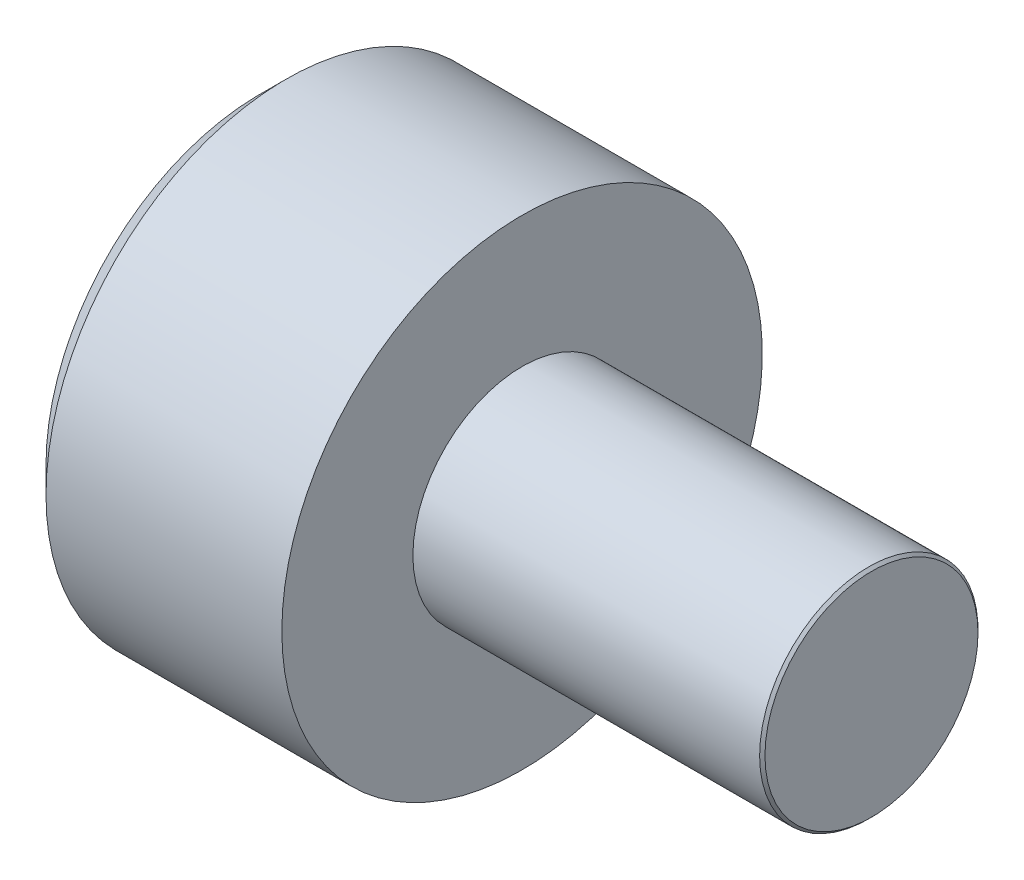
ISO-10303-21;
HEADER;
FILE_DESCRIPTION(('STEP AP214'),'2;1');
FILE_NAME('part.step','',(''),(''),'','','');
FILE_SCHEMA(('AUTOMOTIVE_DESIGN { 1 0 10303 214 1 1 1 1 }'));
ENDSEC;
DATA;
#1=APPLICATION_CONTEXT('core data for automotive mechanical design processes');
#2=APPLICATION_PROTOCOL_DEFINITION('international standard','automotive_design',2000,#1);
#3=PRODUCT_CONTEXT('',#1,'mechanical');
#4=PRODUCT('Part','Part','',(#3));
#5=PRODUCT_RELATED_PRODUCT_CATEGORY('part','',(#4));
#6=PRODUCT_DEFINITION_FORMATION('','',#4);
#7=PRODUCT_DEFINITION_CONTEXT('part definition',#1,'design');
#8=PRODUCT_DEFINITION('design','',#6,#7);
#9=PRODUCT_DEFINITION_SHAPE('','',#8);
#10=(LENGTH_UNIT() NAMED_UNIT(*) SI_UNIT(.MILLI.,.METRE.));
#11=(NAMED_UNIT(*) PLANE_ANGLE_UNIT() SI_UNIT($,.RADIAN.));
#12=(NAMED_UNIT(*) SI_UNIT($,.STERADIAN.) SOLID_ANGLE_UNIT());
#13=UNCERTAINTY_MEASURE_WITH_UNIT(LENGTH_MEASURE(1.E-05),#10,'distance_accuracy_value','');
#14=(GEOMETRIC_REPRESENTATION_CONTEXT(3) GLOBAL_UNCERTAINTY_ASSIGNED_CONTEXT((#13)) GLOBAL_UNIT_ASSIGNED_CONTEXT((#10,
#11,#12)) REPRESENTATION_CONTEXT('',''));
#15=CARTESIAN_POINT('',(0.,0.,0.));
#16=DIRECTION('',(0.,0.,1.));
#17=DIRECTION('',(1.,0.,0.));
#18=AXIS2_PLACEMENT_3D('',#15,#16,#17);
#19=CARTESIAN_POINT('',(0.,0.,0.));
#20=DIRECTION('',(-1.,0.,0.));
#21=DIRECTION('',(0.,0.,1.));
#22=AXIS2_PLACEMENT_3D('',#19,#20,#21);
#23=PLANE('',#22);
#24=DIRECTION('',(0.,-0.499999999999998,0.866025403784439));
#25=VECTOR('',#24,1.);
#26=CARTESIAN_POINT('',(0.,1.47801668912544,0.));
#27=LINE('',#26,#25);
#28=CARTESIAN_POINT('',(0.,1.47801668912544,0.));
#29=VERTEX_POINT('',#28);
#30=CARTESIAN_POINT('',(0.,0.739008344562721,1.28));
#31=VERTEX_POINT('',#30);
#32=EDGE_CURVE('E172',#29,#31,#27,.T.);
#33=ORIENTED_EDGE('',*,*,#32,.T.);
#34=DIRECTION('',(0.,1.,0.));
#35=VECTOR('',#34,1.);
#36=CARTESIAN_POINT('',(0.,-0.739008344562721,1.28));
#37=LINE('',#36,#35);
#38=CARTESIAN_POINT('',(0.,-0.739008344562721,1.28));
#39=VERTEX_POINT('',#38);
#40=EDGE_CURVE('E125',#39,#31,#37,.T.);
#41=ORIENTED_EDGE('',*,*,#40,.F.);
#42=DIRECTION('',(0.,-0.500000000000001,-0.866025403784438));
#43=VECTOR('',#42,1.);
#44=CARTESIAN_POINT('',(0.,-0.739008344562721,1.28));
#45=LINE('',#44,#43);
#46=CARTESIAN_POINT('',(0.,-1.47801668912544,0.));
#47=VERTEX_POINT('',#46);
#48=EDGE_CURVE('E178',#39,#47,#45,.T.);
#49=ORIENTED_EDGE('',*,*,#48,.T.);
#50=DIRECTION('',(0.,0.499999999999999,-0.866025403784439));
#51=VECTOR('',#50,1.);
#52=CARTESIAN_POINT('',(0.,-1.47801668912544,0.));
#53=LINE('',#52,#51);
#54=CARTESIAN_POINT('',(0.,-0.739008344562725,-1.28));
#55=VERTEX_POINT('',#54);
#56=EDGE_CURVE('E185',#47,#55,#53,.T.);
#57=ORIENTED_EDGE('',*,*,#56,.T.);
#58=DIRECTION('',(0.,-1.,0.));
#59=VECTOR('',#58,1.);
#60=CARTESIAN_POINT('',(0.,0.739008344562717,-1.28));
#61=LINE('',#60,#59);
#62=CARTESIAN_POINT('',(0.,0.739008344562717,-1.28));
#63=VERTEX_POINT('',#62);
#64=EDGE_CURVE('E188',#63,#55,#61,.T.);
#65=ORIENTED_EDGE('',*,*,#64,.F.);
#66=DIRECTION('',(0.,-0.500000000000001,-0.866025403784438));
#67=VECTOR('',#66,1.);
#68=CARTESIAN_POINT('',(0.,1.47801668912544,0.));
#69=LINE('',#68,#67);
#70=EDGE_CURVE('E120',#29,#63,#69,.T.);
#71=ORIENTED_EDGE('',*,*,#70,.F.);
#72=EDGE_LOOP('',(#33,#41,#49,#57,#65,#71));
#73=FACE_BOUND('',#72,.T.);
#74=CARTESIAN_POINT('',(0.,0.,0.));
#75=DIRECTION('',(-1.,0.,0.));
#76=DIRECTION('',(0.,0.,1.));
#77=AXIS2_PLACEMENT_3D('',#74,#75,#76);
#78=CIRCLE('',#77,2.45);
#79=CARTESIAN_POINT('',(0.,0.,2.45));
#80=VERTEX_POINT('',#79);
#81=EDGE_CURVE('E11',#80,#80,#78,.T.);
#82=ORIENTED_EDGE('',*,*,#81,.T.);
#83=EDGE_LOOP('',(#82));
#84=FACE_BOUND('',#83,.T.);
#85=ADVANCED_FACE('F34',(#73,#84),#23,.T.);
#86=CARTESIAN_POINT('',(0.,0.,0.));
#87=DIRECTION('',(1.,0.,0.));
#88=DIRECTION('',(0.,0.,-1.));
#89=AXIS2_PLACEMENT_3D('',#86,#87,#88);
#90=CONICAL_SURFACE('',#89,2.45,0.78539816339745);
#91=CARTESIAN_POINT('',(0.3,0.,0.));
#92=DIRECTION('',(-1.,0.,0.));
#93=DIRECTION('',(0.,0.,1.));
#94=AXIS2_PLACEMENT_3D('',#91,#92,#93);
#95=CIRCLE('',#94,2.75);
#96=CARTESIAN_POINT('',(0.3,0.,2.75));
#97=VERTEX_POINT('',#96);
#98=EDGE_CURVE('E41',#97,#97,#95,.T.);
#99=ORIENTED_EDGE('',*,*,#98,.T.);
#100=EDGE_LOOP('',(#99));
#101=FACE_BOUND('',#100,.T.);
#102=ORIENTED_EDGE('',*,*,#81,.F.);
#103=EDGE_LOOP('',(#102));
#104=FACE_BOUND('',#103,.T.);
#105=ADVANCED_FACE('F151',(#101,#104),#90,.T.);
#106=CARTESIAN_POINT('',(-5.30529583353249,0.,0.));
#107=DIRECTION('',(-1.,0.,0.));
#108=DIRECTION('',(0.,0.,1.));
#109=AXIS2_PLACEMENT_3D('',#106,#107,#108);
#110=CYLINDRICAL_SURFACE('',#109,2.75);
#111=CARTESIAN_POINT('',(3.,0.,0.));
#112=DIRECTION('',(-1.,0.,0.));
#113=DIRECTION('',(0.,0.,1.));
#114=AXIS2_PLACEMENT_3D('',#111,#112,#113);
#115=CIRCLE('',#114,2.75);
#116=CARTESIAN_POINT('',(3.,0.,2.75));
#117=VERTEX_POINT('',#116);
#118=EDGE_CURVE('E146',#117,#117,#115,.T.);
#119=ORIENTED_EDGE('',*,*,#118,.T.);
#120=EDGE_LOOP('',(#119));
#121=FACE_BOUND('',#120,.T.);
#122=ORIENTED_EDGE('',*,*,#98,.F.);
#123=EDGE_LOOP('',(#122));
#124=FACE_BOUND('',#123,.T.);
#125=ADVANCED_FACE('F154',(#121,#124),#110,.T.);
#126=CARTESIAN_POINT('',(3.,2.75,0.));
#127=DIRECTION('',(1.,0.,0.));
#128=DIRECTION('',(0.,0.,-1.));
#129=AXIS2_PLACEMENT_3D('',#126,#127,#128);
#130=PLANE('',#129);
#131=CARTESIAN_POINT('',(3.,0.,0.));
#132=DIRECTION('',(-1.,0.,0.));
#133=DIRECTION('',(0.,0.,1.));
#134=AXIS2_PLACEMENT_3D('',#131,#132,#133);
#135=CIRCLE('',#134,1.25);
#136=CARTESIAN_POINT('',(3.,0.,1.25));
#137=VERTEX_POINT('',#136);
#138=EDGE_CURVE('E143',#137,#137,#135,.T.);
#139=ORIENTED_EDGE('',*,*,#138,.T.);
#140=EDGE_LOOP('',(#139));
#141=FACE_BOUND('',#140,.T.);
#142=ORIENTED_EDGE('',*,*,#118,.F.);
#143=EDGE_LOOP('',(#142));
#144=FACE_BOUND('',#143,.T.);
#145=ADVANCED_FACE('F156',(#141,#144),#130,.T.);
#146=CARTESIAN_POINT('',(-5.30529583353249,0.,0.));
#147=DIRECTION('',(-1.,0.,0.));
#148=DIRECTION('',(0.,0.,1.));
#149=AXIS2_PLACEMENT_3D('',#146,#147,#148);
#150=CYLINDRICAL_SURFACE('',#149,1.24999999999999);
#151=CARTESIAN_POINT('',(6.96949999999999,0.,0.));
#152=DIRECTION('',(-1.,0.,0.));
#153=DIRECTION('',(0.,0.,1.));
#154=AXIS2_PLACEMENT_3D('',#151,#152,#153);
#155=CIRCLE('',#154,1.24999999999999);
#156=CARTESIAN_POINT('',(6.96949999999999,0.,1.24999999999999));
#157=VERTEX_POINT('',#156);
#158=EDGE_CURVE('E140',#157,#157,#155,.T.);
#159=ORIENTED_EDGE('',*,*,#158,.T.);
#160=EDGE_LOOP('',(#159));
#161=FACE_BOUND('',#160,.T.);
#162=ORIENTED_EDGE('',*,*,#138,.F.);
#163=EDGE_LOOP('',(#162));
#164=FACE_BOUND('',#163,.T.);
#165=ADVANCED_FACE('F163',(#161,#164),#150,.T.);
#166=CARTESIAN_POINT('',(7.,0.,0.));
#167=DIRECTION('',(-1.,0.,0.));
#168=DIRECTION('',(0.,0.,1.));
#169=AXIS2_PLACEMENT_3D('',#166,#167,#168);
#170=CONICAL_SURFACE('',#169,1.2195,0.785398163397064);
#171=ORIENTED_EDGE('',*,*,#158,.F.);
#172=EDGE_LOOP('',(#171));
#173=FACE_BOUND('',#172,.T.);
#174=CARTESIAN_POINT('',(7.,0.,0.));
#175=DIRECTION('',(-1.,0.,0.));
#176=DIRECTION('',(0.,0.,1.));
#177=AXIS2_PLACEMENT_3D('',#174,#175,#176);
#178=CIRCLE('',#177,1.2195);
#179=CARTESIAN_POINT('',(7.,0.,1.2195));
#180=VERTEX_POINT('',#179);
#181=EDGE_CURVE('E136',#180,#180,#178,.T.);
#182=ORIENTED_EDGE('',*,*,#181,.T.);
#183=EDGE_LOOP('',(#182));
#184=FACE_BOUND('',#183,.T.);
#185=ADVANCED_FACE('F340',(#173,#184),#170,.T.);
#186=CARTESIAN_POINT('',(7.,1.2195,0.));
#187=DIRECTION('',(1.,0.,0.));
#188=DIRECTION('',(0.,0.,-1.));
#189=AXIS2_PLACEMENT_3D('',#186,#187,#188);
#190=PLANE('',#189);
#191=ORIENTED_EDGE('',*,*,#181,.F.);
#192=EDGE_LOOP('',(#191));
#193=FACE_BOUND('',#192,.T.);
#194=ADVANCED_FACE('F325',(#193),#190,.T.);
#195=CARTESIAN_POINT('',(1.3,1.47801668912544,0.));
#196=DIRECTION('',(0.,-0.86602540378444,-0.499999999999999));
#197=DIRECTION('',(0.,0.499999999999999,-0.86602540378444));
#198=AXIS2_PLACEMENT_3D('',#195,#196,#197);
#199=PLANE('',#198);
#200=ORIENTED_EDGE('',*,*,#32,.F.);
#201=DIRECTION('',(-1.,0.,0.));
#202=VECTOR('',#201,1.);
#203=CARTESIAN_POINT('',(1.3,1.47801668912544,0.));
#204=LINE('',#203,#202);
#205=CARTESIAN_POINT('',(1.3,1.47801668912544,0.));
#206=VERTEX_POINT('',#205);
#207=EDGE_CURVE('E191',#206,#29,#204,.T.);
#208=ORIENTED_EDGE('',*,*,#207,.F.);
#209=DIRECTION('',(0.,-0.499999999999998,0.866025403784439));
#210=VECTOR('',#209,1.);
#211=CARTESIAN_POINT('',(1.3,1.47801668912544,0.));
#212=LINE('',#211,#210);
#213=CARTESIAN_POINT('',(1.3,1.10851251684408,0.639999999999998));
#214=VERTEX_POINT('',#213);
#215=EDGE_CURVE('E48',#206,#214,#212,.T.);
#216=ORIENTED_EDGE('',*,*,#215,.T.);
#217=CARTESIAN_POINT('',(1.3,0.739008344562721,1.28));
#218=VERTEX_POINT('',#217);
#219=EDGE_CURVE('E106',#214,#218,#212,.T.);
#220=ORIENTED_EDGE('',*,*,#219,.T.);
#221=DIRECTION('',(-1.,0.,0.));
#222=VECTOR('',#221,1.);
#223=CARTESIAN_POINT('',(1.3,0.739008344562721,1.28));
#224=LINE('',#223,#222);
#225=EDGE_CURVE('E118',#218,#31,#224,.T.);
#226=ORIENTED_EDGE('',*,*,#225,.T.);
#227=EDGE_LOOP('',(#200,#208,#216,#220,#226));
#228=FACE_BOUND('',#227,.T.);
#229=ADVANCED_FACE('F117',(#228),#199,.T.);
#230=CARTESIAN_POINT('',(1.3,-0.739008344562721,1.28));
#231=DIRECTION('',(0.,0.,1.));
#232=DIRECTION('',(0.,-1.,0.));
#233=AXIS2_PLACEMENT_3D('',#230,#231,#232);
#234=PLANE('',#233);
#235=ORIENTED_EDGE('',*,*,#40,.T.);
#236=ORIENTED_EDGE('',*,*,#225,.F.);
#237=DIRECTION('',(0.,1.,0.));
#238=VECTOR('',#237,1.);
#239=CARTESIAN_POINT('',(1.3,-0.739008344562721,1.28));
#240=LINE('',#239,#238);
#241=CARTESIAN_POINT('',(1.3,0.,1.28));
#242=VERTEX_POINT('',#241);
#243=EDGE_CURVE('E104',#242,#218,#240,.T.);
#244=ORIENTED_EDGE('',*,*,#243,.F.);
#245=CARTESIAN_POINT('',(1.3,-0.739008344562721,1.28));
#246=VERTEX_POINT('',#245);
#247=EDGE_CURVE('E114',#246,#242,#240,.T.);
#248=ORIENTED_EDGE('',*,*,#247,.F.);
#249=DIRECTION('',(-1.,0.,0.));
#250=VECTOR('',#249,1.);
#251=CARTESIAN_POINT('',(1.3,-0.739008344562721,1.28));
#252=LINE('',#251,#250);
#253=EDGE_CURVE('E127',#246,#39,#252,.T.);
#254=ORIENTED_EDGE('',*,*,#253,.T.);
#255=EDGE_LOOP('',(#235,#236,#244,#248,#254));
#256=FACE_BOUND('',#255,.T.);
#257=ADVANCED_FACE('F122',(#256),#234,.F.);
#258=CARTESIAN_POINT('',(1.3,-0.739008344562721,1.28));
#259=DIRECTION('',(0.,0.866025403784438,-0.500000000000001));
#260=DIRECTION('',(0.,0.500000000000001,0.866025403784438));
#261=AXIS2_PLACEMENT_3D('',#258,#259,#260);
#262=PLANE('',#261);
#263=ORIENTED_EDGE('',*,*,#48,.F.);
#264=ORIENTED_EDGE('',*,*,#253,.F.);
#265=DIRECTION('',(0.,-0.500000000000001,-0.866025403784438));
#266=VECTOR('',#265,1.);
#267=CARTESIAN_POINT('',(1.3,-0.739008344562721,1.28));
#268=LINE('',#267,#266);
#269=CARTESIAN_POINT('',(1.3,-1.10851251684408,0.640000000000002));
#270=VERTEX_POINT('',#269);
#271=EDGE_CURVE('E231',#246,#270,#268,.T.);
#272=ORIENTED_EDGE('',*,*,#271,.T.);
#273=CARTESIAN_POINT('',(1.3,-1.47801668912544,0.));
#274=VERTEX_POINT('',#273);
#275=EDGE_CURVE('E204',#270,#274,#268,.T.);
#276=ORIENTED_EDGE('',*,*,#275,.T.);
#277=DIRECTION('',(-1.,0.,0.));
#278=VECTOR('',#277,1.);
#279=CARTESIAN_POINT('',(1.3,-1.47801668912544,0.));
#280=LINE('',#279,#278);
#281=EDGE_CURVE('E132',#274,#47,#280,.T.);
#282=ORIENTED_EDGE('',*,*,#281,.T.);
#283=EDGE_LOOP('',(#263,#264,#272,#276,#282));
#284=FACE_BOUND('',#283,.T.);
#285=ADVANCED_FACE('F201',(#284),#262,.T.);
#286=CARTESIAN_POINT('',(1.3,-1.47801668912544,0.));
#287=DIRECTION('',(0.,0.866025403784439,0.499999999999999));
#288=DIRECTION('',(0.,-0.499999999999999,0.866025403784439));
#289=AXIS2_PLACEMENT_3D('',#286,#287,#288);
#290=PLANE('',#289);
#291=ORIENTED_EDGE('',*,*,#56,.F.);
#292=ORIENTED_EDGE('',*,*,#281,.F.);
#293=DIRECTION('',(0.,0.499999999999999,-0.866025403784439));
#294=VECTOR('',#293,1.);
#295=CARTESIAN_POINT('',(1.3,-1.47801668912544,0.));
#296=LINE('',#295,#294);
#297=CARTESIAN_POINT('',(1.3,-1.10851251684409,-0.639999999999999));
#298=VERTEX_POINT('',#297);
#299=EDGE_CURVE('E233',#274,#298,#296,.T.);
#300=ORIENTED_EDGE('',*,*,#299,.T.);
#301=CARTESIAN_POINT('',(1.3,-0.739008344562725,-1.28));
#302=VERTEX_POINT('',#301);
#303=EDGE_CURVE('E212',#298,#302,#296,.T.);
#304=ORIENTED_EDGE('',*,*,#303,.T.);
#305=DIRECTION('',(-1.,0.,0.));
#306=VECTOR('',#305,1.);
#307=CARTESIAN_POINT('',(1.3,-0.739008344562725,-1.28));
#308=LINE('',#307,#306);
#309=EDGE_CURVE('E196',#302,#55,#308,.T.);
#310=ORIENTED_EDGE('',*,*,#309,.T.);
#311=EDGE_LOOP('',(#291,#292,#300,#304,#310));
#312=FACE_BOUND('',#311,.T.);
#313=ADVANCED_FACE('F208',(#312),#290,.T.);
#314=CARTESIAN_POINT('',(1.3,0.739008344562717,-1.28));
#315=DIRECTION('',(0.,0.,-1.));
#316=DIRECTION('',(0.,1.,0.));
#317=AXIS2_PLACEMENT_3D('',#314,#315,#316);
#318=PLANE('',#317);
#319=ORIENTED_EDGE('',*,*,#64,.T.);
#320=ORIENTED_EDGE('',*,*,#309,.F.);
#321=DIRECTION('',(0.,-1.,0.));
#322=VECTOR('',#321,1.);
#323=CARTESIAN_POINT('',(1.3,0.739008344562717,-1.28));
#324=LINE('',#323,#322);
#325=CARTESIAN_POINT('',(1.3,0.,-1.28));
#326=VERTEX_POINT('',#325);
#327=EDGE_CURVE('E217',#326,#302,#324,.T.);
#328=ORIENTED_EDGE('',*,*,#327,.F.);
#329=CARTESIAN_POINT('',(1.3,0.739008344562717,-1.28));
#330=VERTEX_POINT('',#329);
#331=EDGE_CURVE('E220',#330,#326,#324,.T.);
#332=ORIENTED_EDGE('',*,*,#331,.F.);
#333=DIRECTION('',(-1.,0.,0.));
#334=VECTOR('',#333,1.);
#335=CARTESIAN_POINT('',(1.3,0.739008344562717,-1.28));
#336=LINE('',#335,#334);
#337=EDGE_CURVE('E193',#330,#63,#336,.T.);
#338=ORIENTED_EDGE('',*,*,#337,.T.);
#339=EDGE_LOOP('',(#319,#320,#328,#332,#338));
#340=FACE_BOUND('',#339,.T.);
#341=ADVANCED_FACE('F215',(#340),#318,.F.);
#342=CARTESIAN_POINT('',(1.3,1.47801668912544,0.));
#343=DIRECTION('',(0.,0.866025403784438,-0.500000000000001));
#344=DIRECTION('',(0.,0.500000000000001,0.866025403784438));
#345=AXIS2_PLACEMENT_3D('',#342,#343,#344);
#346=PLANE('',#345);
#347=ORIENTED_EDGE('',*,*,#70,.T.);
#348=ORIENTED_EDGE('',*,*,#337,.F.);
#349=DIRECTION('',(0.,-0.500000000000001,-0.866025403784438));
#350=VECTOR('',#349,1.);
#351=CARTESIAN_POINT('',(1.3,1.47801668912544,0.));
#352=LINE('',#351,#350);
#353=CARTESIAN_POINT('',(1.3,1.10851251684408,-0.640000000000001));
#354=VERTEX_POINT('',#353);
#355=EDGE_CURVE('E225',#354,#330,#352,.T.);
#356=ORIENTED_EDGE('',*,*,#355,.F.);
#357=EDGE_CURVE('E181',#206,#354,#352,.T.);
#358=ORIENTED_EDGE('',*,*,#357,.F.);
#359=ORIENTED_EDGE('',*,*,#207,.T.);
#360=EDGE_LOOP('',(#347,#348,#356,#358,#359));
#361=FACE_BOUND('',#360,.T.);
#362=ADVANCED_FACE('F223',(#361),#346,.F.);
#363=CARTESIAN_POINT('',(1.3,0.73900834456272,1.28));
#364=DIRECTION('',(-1.,0.,0.));
#365=DIRECTION('',(0.,0.,1.));
#366=AXIS2_PLACEMENT_3D('',#363,#364,#365);
#367=PLANE('',#366);
#368=CARTESIAN_POINT('',(1.3,0.,0.));
#369=DIRECTION('',(-1.,0.,0.));
#370=DIRECTION('',(0.,0.,1.));
#371=AXIS2_PLACEMENT_3D('',#368,#369,#370);
#372=CIRCLE('',#371,1.28);
#373=EDGE_CURVE('E126',#270,#242,#372,.T.);
#374=ORIENTED_EDGE('',*,*,#373,.F.);
#375=ORIENTED_EDGE('',*,*,#271,.F.);
#376=ORIENTED_EDGE('',*,*,#247,.T.);
#377=EDGE_LOOP('',(#374,#375,#376));
#378=FACE_BOUND('',#377,.T.);
#379=ADVANCED_FACE('F248',(#378),#367,.T.);
#380=EDGE_CURVE('E130',#298,#270,#372,.T.);
#381=ORIENTED_EDGE('',*,*,#380,.F.);
#382=ORIENTED_EDGE('',*,*,#299,.F.);
#383=ORIENTED_EDGE('',*,*,#275,.F.);
#384=EDGE_LOOP('',(#381,#382,#383));
#385=FACE_BOUND('',#384,.T.);
#386=ADVANCED_FACE('F245',(#385),#367,.T.);
#387=EDGE_CURVE('E239',#326,#298,#372,.T.);
#388=ORIENTED_EDGE('',*,*,#387,.F.);
#389=ORIENTED_EDGE('',*,*,#327,.T.);
#390=ORIENTED_EDGE('',*,*,#303,.F.);
#391=EDGE_LOOP('',(#388,#389,#390));
#392=FACE_BOUND('',#391,.T.);
#393=ADVANCED_FACE('F237',(#392),#367,.T.);
#394=EDGE_CURVE('E242',#354,#326,#372,.T.);
#395=ORIENTED_EDGE('',*,*,#394,.F.);
#396=ORIENTED_EDGE('',*,*,#355,.T.);
#397=ORIENTED_EDGE('',*,*,#331,.T.);
#398=EDGE_LOOP('',(#395,#396,#397));
#399=FACE_BOUND('',#398,.T.);
#400=ADVANCED_FACE('F262',(#399),#367,.T.);
#401=EDGE_CURVE('E137',#214,#354,#372,.T.);
#402=ORIENTED_EDGE('',*,*,#401,.F.);
#403=ORIENTED_EDGE('',*,*,#215,.F.);
#404=ORIENTED_EDGE('',*,*,#357,.T.);
#405=EDGE_LOOP('',(#402,#403,#404));
#406=FACE_BOUND('',#405,.T.);
#407=ADVANCED_FACE('F228',(#406),#367,.T.);
#408=EDGE_CURVE('E109',#242,#214,#372,.T.);
#409=ORIENTED_EDGE('',*,*,#408,.F.);
#410=ORIENTED_EDGE('',*,*,#243,.T.);
#411=ORIENTED_EDGE('',*,*,#219,.F.);
#412=EDGE_LOOP('',(#409,#410,#411));
#413=FACE_BOUND('',#412,.T.);
#414=ADVANCED_FACE('F105',(#413),#367,.T.);
#415=CARTESIAN_POINT('',(1.3,0.,0.));
#416=DIRECTION('',(-1.,0.,0.));
#417=DIRECTION('',(0.,0.,1.));
#418=AXIS2_PLACEMENT_3D('',#415,#416,#417);
#419=CONICAL_SURFACE('',#418,1.28,1.04719755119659);
#420=CARTESIAN_POINT('',(2.03900834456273,0.,0.));
#421=VERTEX_POINT('',#420);
#422=VERTEX_LOOP('',#421);
#423=FACE_BOUND('',#422,.T.);
#424=ORIENTED_EDGE('',*,*,#408,.T.);
#425=ORIENTED_EDGE('',*,*,#401,.T.);
#426=ORIENTED_EDGE('',*,*,#394,.T.);
#427=ORIENTED_EDGE('',*,*,#387,.T.);
#428=ORIENTED_EDGE('',*,*,#380,.T.);
#429=ORIENTED_EDGE('',*,*,#373,.T.);
#430=EDGE_LOOP('',(#424,#425,#426,#427,#428,#429));
#431=FACE_BOUND('',#430,.T.);
#432=ADVANCED_FACE('F243',(#423,#431),#419,.F.);
#433=CLOSED_SHELL('',(#85,#105,#125,#145,#165,#185,#194,#229,#257,#285,#313,#341,#362,#379,#386,
#393,#400,#407,#414,#432));
#434=MANIFOLD_SOLID_BREP('B2',#433);
#435=ADVANCED_BREP_SHAPE_REPRESENTATION('',(#18,#434),#14);
#436=SHAPE_DEFINITION_REPRESENTATION(#9,#435);
ENDSEC;
END-ISO-10303-21;
